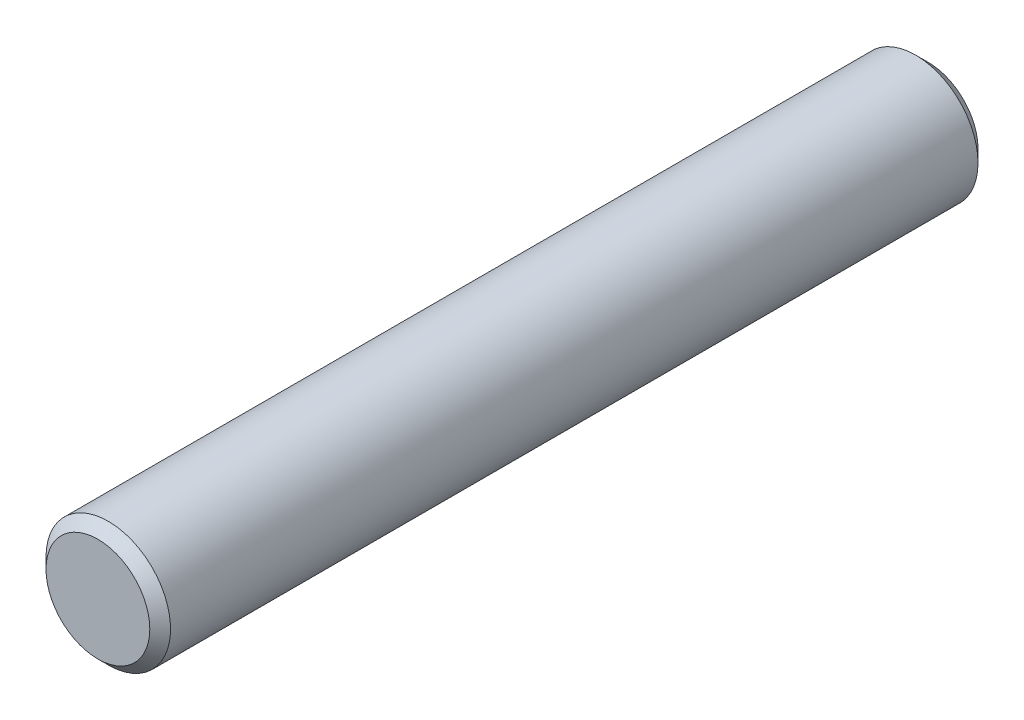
from build123d import *

# Parameters (mm, degrees)
SKETCH1_R          = 2.38125
EXTRUDE1_DEPTH     = 38.1
CHAMFER1_SIZE      = 0.47625
SKETCH3_R          = 11.007776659
CUT_EXTRUDE1_DEPTH = 44.45
CHAMFER2_SIZE      = 0.396875


with BuildPart() as part:
    # Sketch1 → Extrude1 (new, symmetric)
    with BuildSketch(Plane.XY):
        with Locations(Location((0, 0, 0), (0, 0, 180))):
            Circle(SKETCH1_R)
    extrude(amount=EXTRUDE1_DEPTH, both=True)

    # Chamfer1
    chamfer1_edges = [part.edges().sort_by_distance(p)[0] for p in [
        (2.38125, 0, -38.1),
        (2.38125, 0, 38.1),
    ]]
    chamfer(chamfer1_edges, length=CHAMFER1_SIZE)

    # Sketch3 → Cut-Extrude1 (cut)
    with BuildSketch(Plane.XY.offset(38.1)):
        Circle(SKETCH3_R)
    extrude(amount=-CUT_EXTRUDE1_DEPTH, mode=Mode.SUBTRACT)

    # Chamfer2
    chamfer2_edges = [part.edges().sort_by_distance(p)[0] for p in [
        (2.38125, 0, -6.35),
    ]]
    chamfer(chamfer2_edges, length=CHAMFER2_SIZE)


solid = part.part
